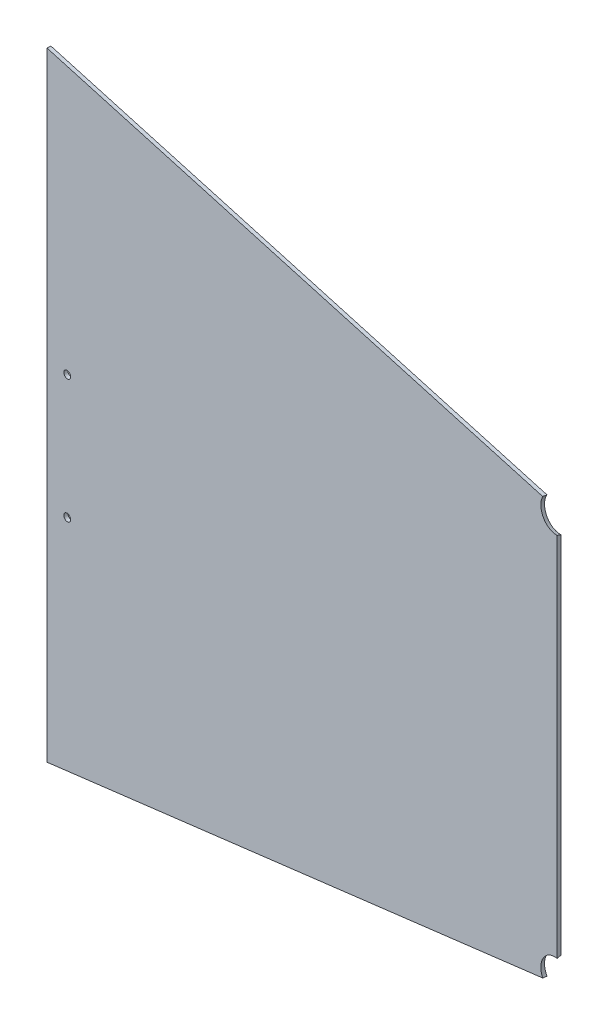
from build123d import *

# Parameters (mm, degrees)
BOSS_EXTRUDE1_DEPTH = 3.175
SKETCH2_R           = 14.2875
CUT_EXTRUDE1_DEPTH  = 837.34562622
CUT_EXTRUDE2_DEPTH  = 880.199971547
SKETCH4_R           = 3.175
CUT_EXTRUDE3_DEPTH  = 870.180090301


with BuildPart() as part:
    # Sketch1 → Boss-Extrude1 (new body)
    with BuildSketch(Plane(origin=(1.950344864, 0, -26.264644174), x_dir=(-0.9972542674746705, 0, -0.07405353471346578), z_dir=(0.07405353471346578, 0, -0.9972542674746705))):
        Polygon((-183.644373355, -298.45), (-183.644373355, 298.45), (-826.760197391, 177.8), (-826.760197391, -177.8), align=None)
    extrude(amount=BOSS_EXTRUDE1_DEPTH)

    # Sketch2 → Cut-Extrude1 (cut, through all)
    with BuildSketch(Plane(origin=(825.5, 212.942802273, 150.983020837), x_dir=(1, 0, 0), z_dir=(0, 0.32191156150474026, 0.9467697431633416))):
        Circle(SKETCH2_R)
    cut_extrude1 = extrude(amount=-CUT_EXTRUDE1_DEPTH, mode=Mode.SUBTRACT)

    # Mirror1: Cut-Extrude1 across plane
    add(cut_extrude1.mirror(Plane.ZX), mode=Mode.SUBTRACT)

    # Sketch3 → Cut-Extrude2 (cut, through all)
    with BuildSketch(Plane(origin=(1.950344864, 0, -26.264644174), x_dir=(0.9972542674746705, 0, 0.0740535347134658), z_dir=(-0.0740535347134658, 0, 0.9972542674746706))):
        Polygon((348.744373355, -267.476862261), (348.744373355, 267.476862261), (183.644373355, 298.45), (183.644373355, -298.45), align=None)
    extrude(amount=-CUT_EXTRUDE2_DEPTH, mode=Mode.SUBTRACT)

    # Sketch4 → Cut-Extrude3 (cut, through all)
    with BuildSketch(Plane(origin=(2.185464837, 0, -29.430926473), x_dir=(-0.9972542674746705, 0, -0.0740535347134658), z_dir=(0.0740535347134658, 0, -0.9972542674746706))):
        with Locations((-367.794373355, 33)):
            Circle(SKETCH4_R)
        with Locations((-367.794373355, -74)):
            Circle(SKETCH4_R)
    extrude(amount=-CUT_EXTRUDE3_DEPTH, mode=Mode.SUBTRACT)


solid = part.part
